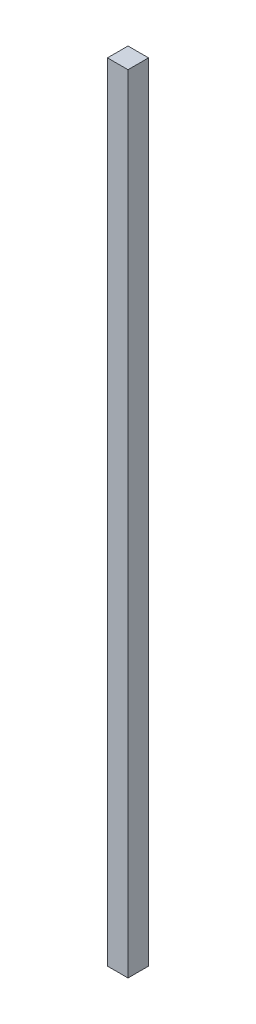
from build123d import *

# Parameters (mm, degrees)
SKETCH_1_W      = 60
SKETCH_1_H      = 60
EXTRUDE_1_DEPTH = 2300


with BuildPart() as part:
    # Sketch 1 → Extrude 1 (new body)
    with BuildSketch(Plane(origin=(0, 0, 0), x_dir=(1, 0, 0), z_dir=(0, 1, 0))):
        Rectangle(SKETCH_1_W, SKETCH_1_H)
    extrude(amount=EXTRUDE_1_DEPTH)


solid = part.part
